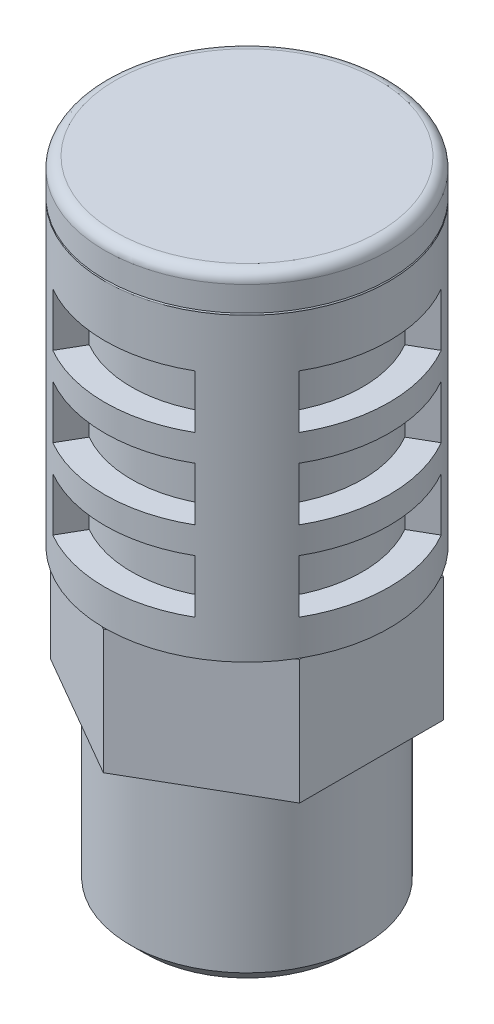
from build123d import *
from build123d.topology import SkipClean

# Parameters (mm, degrees)
CUT_REVOLVE_1_ANGLE           = 30
CUT_REVOLVE_1_OTHER_WAY_ANGLE = 30
CUT_REVOLVE_2_ANGLE           = 30
CUT_REVOLVE_2_OTHER_WAY_ANGLE = 30
CUT_REVOLVE_3_ANGLE           = 30
CUT_REVOLVE_3_OTHER_WAY_ANGLE = 30
CUT_REVOLVE_4_ANGLE           = 30
CUT_REVOLVE_4_OTHER_WAY_ANGLE = 30
SKETCH_6_R                    = 14
CUT_EXTRUDE_1_DEPTH           = 7


with BuildPart() as part:
    # Sketch 1 → Revolve 1 (revolve)
    with BuildSketch(Plane.XY, mode=Mode.PRIVATE) as revolve_1_sk:
        with BuildLine():
            Line((0, 36), (7.4, 36))
            ThreePointArc((7.4, 36), (7.824264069, 35.824264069), (8, 35.4))
            Line((8, 35.4), (8, 34))
            Line((8, 34), (7.9, 34))
            ThreePointArc((7.9, 34), (7.970710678, 33.970710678), (8, 33.9))
            Line((8, 33.9), (8, 17))
            Line((8, 17), (8.082903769, 17))
            Line((8.082903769, 17), (8.082903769, 10))
            Line((8.082903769, 10), (6.5785, 10))
            Line((6.5785, 10), (6.5785, 0.856))
            Line((6.5785, 0.856), (5.7225, 0))
            Line((5.7225, 0), (3.28925, 0))
            Line((3.28925, 0), (3.28925, 31))
            Line((3.28925, 31), (0, 32.899049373))
            Line((0, 32.899049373), (0, 36))
        make_face()
    revolve(revolve_1_sk.sketch.rotate(Axis((0, 0, 0), (0, 1, 0)), 180), axis=Axis((0, 0, 0), (0, 1, 0)))

    # Sketch 2 → Cut-Revolve 1 (revolve, cut)
    with SkipClean():  # the faces are left unmerged after this step: merging them gives an invalid solid
        with BuildSketch(Plane.XY):
            Polygon((6.5, 28), (8, 28), (8, 26.5), (6.5, 26.5), (6.5, 23.5), (8, 23.5), (8, 22), (6.5, 22), (6.5, 19), (16, 19), (16, 31), (6.5, 31), align=None)
        revolve(axis=Axis((0, 19, 0), (0, 1, 0)), revolution_arc=CUT_REVOLVE_1_ANGLE, mode=Mode.SUBTRACT)

    # Sketch 2 → Cut-Revolve 1 other way (revolve, cut)
    with SkipClean():  # the faces are left unmerged after this step: merging them gives an invalid solid
        with BuildSketch(Plane.XY):
            Polygon((6.5, 28), (8, 28), (8, 26.5), (6.5, 26.5), (6.5, 23.5), (8, 23.5), (8, 22), (6.5, 22), (6.5, 19), (16, 19), (16, 31), (6.5, 31), align=None)
        revolve(axis=Axis((0, 19, 0), (0, -1, 0)), revolution_arc=CUT_REVOLVE_1_OTHER_WAY_ANGLE, mode=Mode.SUBTRACT)

    # Sketch 3 → Cut-Revolve 2 (revolve, cut)
    with SkipClean():  # the faces are left unmerged after this step: merging them gives an invalid solid
        with BuildSketch(Plane.XY):
            Polygon((-16, 31), (-16, 19), (-6.5, 19), (-6.5, 22), (-8, 22), (-8, 23.5), (-6.5, 23.5), (-6.5, 26.5), (-8, 26.5), (-8, 28), (-6.5, 28), (-6.5, 31), align=None)
        revolve(axis=Axis((0, 31, 0), (0, -1, 0)), revolution_arc=CUT_REVOLVE_2_ANGLE, mode=Mode.SUBTRACT)

    # Sketch 3 → Cut-Revolve 2 other way (revolve, cut)
    with SkipClean():  # the faces are left unmerged after this step: merging them gives an invalid solid
        with BuildSketch(Plane.XY):
            Polygon((-16, 31), (-16, 19), (-6.5, 19), (-6.5, 22), (-8, 22), (-8, 23.5), (-6.5, 23.5), (-6.5, 26.5), (-8, 26.5), (-8, 28), (-6.5, 28), (-6.5, 31), align=None)
        revolve(axis=Axis((0, 31, 0), (0, 1, 0)), revolution_arc=CUT_REVOLVE_2_OTHER_WAY_ANGLE, mode=Mode.SUBTRACT)

    # Sketch 4 → Cut-Revolve 3 (revolve, cut)
    with SkipClean():  # the faces are left unmerged after this step: merging them gives an invalid solid
        with BuildSketch(Plane(origin=(0, 0, 0), x_dir=(0, 0, -1), z_dir=(1, 0, 0))):
            Polygon((6.5, 28), (8, 28), (8, 26.5), (6.5, 26.5), (6.5, 23.5), (8, 23.5), (8, 22), (6.5, 22), (6.5, 19), (16, 19), (16, 31), (6.5, 31), align=None)
        revolve(axis=Axis((0, 19, 0), (0, 1, 0)), revolution_arc=CUT_REVOLVE_3_ANGLE, mode=Mode.SUBTRACT)

    # Sketch 4 → Cut-Revolve 3 other way (revolve, cut)
    with SkipClean():  # the faces are left unmerged after this step: merging them gives an invalid solid
        with BuildSketch(Plane(origin=(0, 0, 0), x_dir=(0, 0, -1), z_dir=(1, 0, 0))):
            Polygon((6.5, 28), (8, 28), (8, 26.5), (6.5, 26.5), (6.5, 23.5), (8, 23.5), (8, 22), (6.5, 22), (6.5, 19), (16, 19), (16, 31), (6.5, 31), align=None)
        revolve(axis=Axis((0, 19, 0), (0, -1, 0)), revolution_arc=CUT_REVOLVE_3_OTHER_WAY_ANGLE, mode=Mode.SUBTRACT)

    # Sketch 5 → Cut-Revolve 4 (revolve, cut)
    with SkipClean():  # the faces are left unmerged after this step: merging them gives an invalid solid
        with BuildSketch(Plane(origin=(0, 0, 0), x_dir=(0, 0, -1), z_dir=(1, 0, 0))):
            Polygon((-16, 31), (-16, 19), (-6.5, 19), (-6.5, 22), (-8, 22), (-8, 23.5), (-6.5, 23.5), (-6.5, 26.5), (-8, 26.5), (-8, 28), (-6.5, 28), (-6.5, 31), align=None)
        revolve(axis=Axis((0, 31, 0), (0, -1, 0)), revolution_arc=CUT_REVOLVE_4_ANGLE, mode=Mode.SUBTRACT)

    # Sketch 5 → Cut-Revolve 4 other way (revolve, cut)
    with SkipClean():  # the faces are left unmerged after this step: merging them gives an invalid solid
        with BuildSketch(Plane(origin=(0, 0, 0), x_dir=(0, 0, -1), z_dir=(1, 0, 0))):
            Polygon((-16, 31), (-16, 19), (-6.5, 19), (-6.5, 22), (-8, 22), (-8, 23.5), (-6.5, 23.5), (-6.5, 26.5), (-8, 26.5), (-8, 28), (-6.5, 28), (-6.5, 31), align=None)
        revolve(axis=Axis((0, 31, 0), (0, 1, 0)), revolution_arc=CUT_REVOLVE_4_OTHER_WAY_ANGLE, mode=Mode.SUBTRACT)

    # Sketch 6 → Cut-Extrude 1 (cut)
    with SkipClean():  # the faces are left unmerged after this step: merging them gives an invalid solid
        with BuildSketch(Plane(origin=(0, 10, 0), x_dir=(1, 0, 0), z_dir=(0, 1, 0))):
            Circle(SKETCH_6_R)
            Polygon((-7, -4.041451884), (0, -8.082903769), (7, -4.041451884), (7, 4.041451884), (0, 8.082903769), (-7, 4.041451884), align=None, mode=Mode.SUBTRACT)
        extrude(amount=CUT_EXTRUDE_1_DEPTH, mode=Mode.SUBTRACT)


solid = part.part
